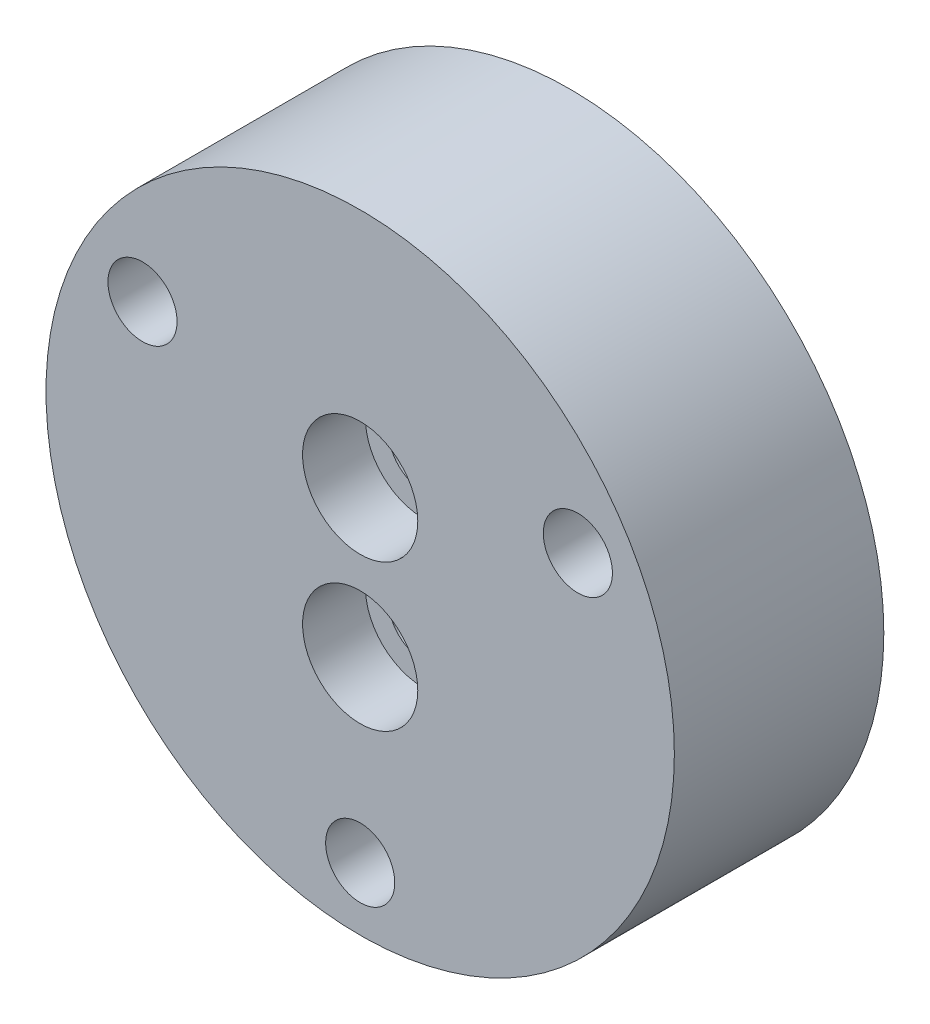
from build123d import *

# Parameters (mm, degrees)
ESQUISSE1_R                                        = 30
EXTRUSION1_DEPTH                                   = 20
CHAMBRAGE_POUR_VIS_T_TE_HEXAGONALE_M61_D           = 6.6
CHAMBRAGE_POUR_VIS_T_TE_HEXAGONALE_M61_CBORE_D     = 11
CHAMBRAGE_POUR_VIS_T_TE_HEXAGONALE_M61_CBORE_DEPTH = 6
CHAMBRAGE_POUR_VIS_T_TE_HEXAGONALE_M62_D           = 6.6
CHAMBRAGE_POUR_VIS_T_TE_HEXAGONALE_M62_CBORE_D     = 11
CHAMBRAGE_POUR_VIS_T_TE_HEXAGONALE_M62_CBORE_DEPTH = 6
R_P_TITION_CIRCULAIRE1_COUNT                       = 3


with BuildPart() as part:
    # Esquisse1 → Extrusion1 (new body)
    with BuildSketch(Plane.XY):
        Circle(ESQUISSE1_R)
    extrude(amount=EXTRUSION1_DEPTH)

    # Chambrage pour vis _ t_te hexagonale M61 (through all)
    with Locations(Plane.XY.offset(20)):
        with Locations((0, 7), (0, -7)):
            CounterBoreHole(CHAMBRAGE_POUR_VIS_T_TE_HEXAGONALE_M61_D / 2, CHAMBRAGE_POUR_VIS_T_TE_HEXAGONALE_M61_CBORE_D / 2, CHAMBRAGE_POUR_VIS_T_TE_HEXAGONALE_M61_CBORE_DEPTH)

    # Chambrage pour vis _ t_te hexagonale M62 (through all)
    with Locations(Plane(origin=(0, 0, 0), x_dir=(-1, 0, 0), z_dir=(0, 0, -1))):
        with Locations((0, -24)):
            chambrage_pour_vis_t_te_hexagonale_m62 = CounterBoreHole(CHAMBRAGE_POUR_VIS_T_TE_HEXAGONALE_M62_D / 2, CHAMBRAGE_POUR_VIS_T_TE_HEXAGONALE_M62_CBORE_D / 2, CHAMBRAGE_POUR_VIS_T_TE_HEXAGONALE_M62_CBORE_DEPTH)

    # R_p_tition circulaire1: Chambrage pour vis _ t_te hexagonale M62 ×3 about axis
    r_p_tition_circulaire1_axis = Axis((0, 0, 0), (0, 0, 1))
    for i in range(1, R_P_TITION_CIRCULAIRE1_COUNT):
        add(chambrage_pour_vis_t_te_hexagonale_m62.rotate(r_p_tition_circulaire1_axis, i * 360 / R_P_TITION_CIRCULAIRE1_COUNT), mode=Mode.SUBTRACT)


solid = part.part
